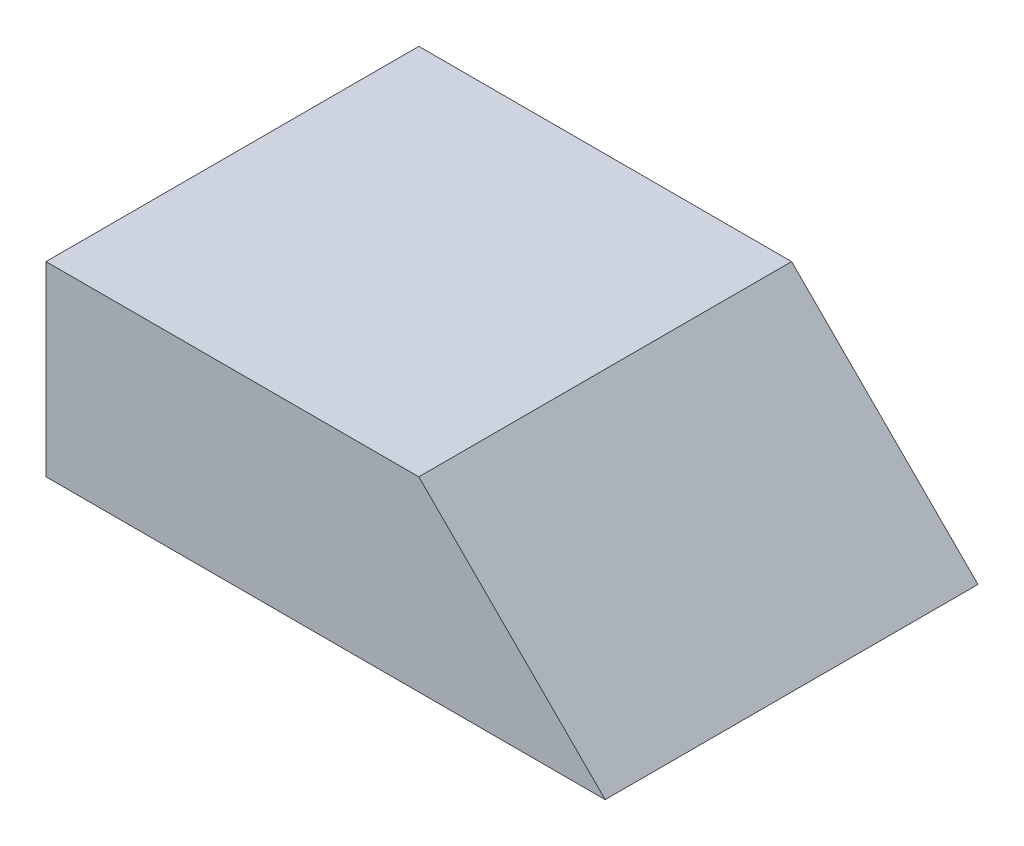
ISO-10303-21;
HEADER;
FILE_DESCRIPTION(('STEP AP214'),'2;1');
FILE_NAME('part.step','',(''),(''),'','','');
FILE_SCHEMA(('AUTOMOTIVE_DESIGN { 1 0 10303 214 1 1 1 1 }'));
ENDSEC;
DATA;
#1=APPLICATION_CONTEXT('core data for automotive mechanical design processes');
#2=APPLICATION_PROTOCOL_DEFINITION('international standard','automotive_design',2000,#1);
#3=PRODUCT_CONTEXT('',#1,'mechanical');
#4=PRODUCT('Part','Part','',(#3));
#5=PRODUCT_RELATED_PRODUCT_CATEGORY('part','',(#4));
#6=PRODUCT_DEFINITION_FORMATION('','',#4);
#7=PRODUCT_DEFINITION_CONTEXT('part definition',#1,'design');
#8=PRODUCT_DEFINITION('design','',#6,#7);
#9=PRODUCT_DEFINITION_SHAPE('','',#8);
#10=(LENGTH_UNIT() NAMED_UNIT(*) SI_UNIT(.MILLI.,.METRE.));
#11=(NAMED_UNIT(*) PLANE_ANGLE_UNIT() SI_UNIT($,.RADIAN.));
#12=(NAMED_UNIT(*) SI_UNIT($,.STERADIAN.) SOLID_ANGLE_UNIT());
#13=UNCERTAINTY_MEASURE_WITH_UNIT(LENGTH_MEASURE(1.E-05),#10,'distance_accuracy_value','');
#14=(GEOMETRIC_REPRESENTATION_CONTEXT(3) GLOBAL_UNCERTAINTY_ASSIGNED_CONTEXT((#13)) GLOBAL_UNIT_ASSIGNED_CONTEXT((#10,
#11,#12)) REPRESENTATION_CONTEXT('',''));
#15=CARTESIAN_POINT('',(0.,0.,0.));
#16=DIRECTION('',(0.,0.,1.));
#17=DIRECTION('',(1.,0.,0.));
#18=AXIS2_PLACEMENT_3D('',#15,#16,#17);
#19=CARTESIAN_POINT('',(-3.,0.,2.));
#20=DIRECTION('',(1.,0.,0.));
#21=DIRECTION('',(0.,1.,0.));
#22=AXIS2_PLACEMENT_3D('',#19,#20,#21);
#23=PLANE('',#22);
#24=DIRECTION('',(0.,-1.,0.));
#25=VECTOR('',#24,1.);
#26=CARTESIAN_POINT('',(-3.,0.,0.));
#27=LINE('',#26,#25);
#28=CARTESIAN_POINT('',(-3.,1.,0.));
#29=VERTEX_POINT('',#28);
#30=CARTESIAN_POINT('',(-3.,0.,0.));
#31=VERTEX_POINT('',#30);
#32=EDGE_CURVE('E107',#29,#31,#27,.T.);
#33=ORIENTED_EDGE('',*,*,#32,.T.);
#34=DIRECTION('',(0.,0.,-1.));
#35=VECTOR('',#34,1.);
#36=CARTESIAN_POINT('',(-3.,0.,2.));
#37=LINE('',#36,#35);
#38=CARTESIAN_POINT('',(-3.,0.,2.));
#39=VERTEX_POINT('',#38);
#40=EDGE_CURVE('E11',#39,#31,#37,.T.);
#41=ORIENTED_EDGE('',*,*,#40,.F.);
#42=DIRECTION('',(0.,-1.,0.));
#43=VECTOR('',#42,1.);
#44=CARTESIAN_POINT('',(-3.,0.,2.));
#45=LINE('',#44,#43);
#46=CARTESIAN_POINT('',(-3.,1.,2.));
#47=VERTEX_POINT('',#46);
#48=EDGE_CURVE('E91',#47,#39,#45,.T.);
#49=ORIENTED_EDGE('',*,*,#48,.F.);
#50=DIRECTION('',(0.,0.,-1.));
#51=VECTOR('',#50,1.);
#52=CARTESIAN_POINT('',(-3.,1.,2.));
#53=LINE('',#52,#51);
#54=EDGE_CURVE('E103',#47,#29,#53,.T.);
#55=ORIENTED_EDGE('',*,*,#54,.T.);
#56=EDGE_LOOP('',(#33,#41,#49,#55));
#57=FACE_BOUND('',#56,.T.);
#58=ADVANCED_FACE('F39',(#57),#23,.F.);
#59=CARTESIAN_POINT('',(-3.,0.,2.));
#60=DIRECTION('',(0.,1.,0.));
#61=DIRECTION('',(0.,0.,1.));
#62=AXIS2_PLACEMENT_3D('',#59,#60,#61);
#63=PLANE('',#62);
#64=DIRECTION('',(1.,0.,0.));
#65=VECTOR('',#64,1.);
#66=CARTESIAN_POINT('',(-3.,0.,0.));
#67=LINE('',#66,#65);
#68=CARTESIAN_POINT('',(0.,0.,0.));
#69=VERTEX_POINT('',#68);
#70=EDGE_CURVE('E96',#31,#69,#67,.T.);
#71=ORIENTED_EDGE('',*,*,#70,.T.);
#72=DIRECTION('',(0.,0.,-1.));
#73=VECTOR('',#72,1.);
#74=CARTESIAN_POINT('',(0.,0.,2.));
#75=LINE('',#74,#73);
#76=CARTESIAN_POINT('',(0.,0.,2.));
#77=VERTEX_POINT('',#76);
#78=EDGE_CURVE('E48',#77,#69,#75,.T.);
#79=ORIENTED_EDGE('',*,*,#78,.F.);
#80=DIRECTION('',(1.,0.,0.));
#81=VECTOR('',#80,1.);
#82=CARTESIAN_POINT('',(-3.,0.,2.));
#83=LINE('',#82,#81);
#84=EDGE_CURVE('E86',#39,#77,#83,.T.);
#85=ORIENTED_EDGE('',*,*,#84,.F.);
#86=ORIENTED_EDGE('',*,*,#40,.T.);
#87=EDGE_LOOP('',(#71,#79,#85,#86));
#88=FACE_BOUND('',#87,.T.);
#89=ADVANCED_FACE('F95',(#88),#63,.F.);
#90=CARTESIAN_POINT('',(-1.,1.,2.));
#91=DIRECTION('',(-0.707106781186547,-0.707106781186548,0.));
#92=DIRECTION('',(0.707106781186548,-0.707106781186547,0.));
#93=AXIS2_PLACEMENT_3D('',#90,#91,#92);
#94=PLANE('',#93);
#95=DIRECTION('',(-0.707106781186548,0.707106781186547,0.));
#96=VECTOR('',#95,1.);
#97=CARTESIAN_POINT('',(-1.,1.,0.));
#98=LINE('',#97,#96);
#99=CARTESIAN_POINT('',(-1.,1.,0.));
#100=VERTEX_POINT('',#99);
#101=EDGE_CURVE('E73',#69,#100,#98,.T.);
#102=ORIENTED_EDGE('',*,*,#101,.T.);
#103=DIRECTION('',(0.,0.,-1.));
#104=VECTOR('',#103,1.);
#105=CARTESIAN_POINT('',(-1.,1.,2.));
#106=LINE('',#105,#104);
#107=CARTESIAN_POINT('',(-1.,1.,2.));
#108=VERTEX_POINT('',#107);
#109=EDGE_CURVE('E98',#108,#100,#106,.T.);
#110=ORIENTED_EDGE('',*,*,#109,.F.);
#111=DIRECTION('',(-0.707106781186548,0.707106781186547,0.));
#112=VECTOR('',#111,1.);
#113=CARTESIAN_POINT('',(-1.,1.,2.));
#114=LINE('',#113,#112);
#115=EDGE_CURVE('E89',#77,#108,#114,.T.);
#116=ORIENTED_EDGE('',*,*,#115,.F.);
#117=ORIENTED_EDGE('',*,*,#78,.T.);
#118=EDGE_LOOP('',(#102,#110,#116,#117));
#119=FACE_BOUND('',#118,.T.);
#120=ADVANCED_FACE('F99',(#119),#94,.F.);
#121=CARTESIAN_POINT('',(-3.,1.,2.));
#122=DIRECTION('',(0.,-1.,0.));
#123=DIRECTION('',(0.,0.,-1.));
#124=AXIS2_PLACEMENT_3D('',#121,#122,#123);
#125=PLANE('',#124);
#126=DIRECTION('',(-1.,0.,0.));
#127=VECTOR('',#126,1.);
#128=CARTESIAN_POINT('',(-3.,1.,0.));
#129=LINE('',#128,#127);
#130=EDGE_CURVE('E79',#100,#29,#129,.T.);
#131=ORIENTED_EDGE('',*,*,#130,.T.);
#132=ORIENTED_EDGE('',*,*,#54,.F.);
#133=DIRECTION('',(-1.,0.,0.));
#134=VECTOR('',#133,1.);
#135=CARTESIAN_POINT('',(-3.,1.,2.));
#136=LINE('',#135,#134);
#137=EDGE_CURVE('E56',#108,#47,#136,.T.);
#138=ORIENTED_EDGE('',*,*,#137,.F.);
#139=ORIENTED_EDGE('',*,*,#109,.T.);
#140=EDGE_LOOP('',(#131,#132,#138,#139));
#141=FACE_BOUND('',#140,.T.);
#142=ADVANCED_FACE('F120',(#141),#125,.F.);
#143=CARTESIAN_POINT('',(0.,0.,2.));
#144=DIRECTION('',(0.,0.,-1.));
#145=DIRECTION('',(-1.,0.,0.));
#146=AXIS2_PLACEMENT_3D('',#143,#144,#145);
#147=PLANE('',#146);
#148=ORIENTED_EDGE('',*,*,#48,.T.);
#149=ORIENTED_EDGE('',*,*,#84,.T.);
#150=ORIENTED_EDGE('',*,*,#115,.T.);
#151=ORIENTED_EDGE('',*,*,#137,.T.);
#152=EDGE_LOOP('',(#148,#149,#150,#151));
#153=FACE_BOUND('',#152,.T.);
#154=ADVANCED_FACE('F87',(#153),#147,.F.);
#155=CARTESIAN_POINT('',(0.,0.,0.));
#156=DIRECTION('',(0.,0.,-1.));
#157=DIRECTION('',(-1.,0.,0.));
#158=AXIS2_PLACEMENT_3D('',#155,#156,#157);
#159=PLANE('',#158);
#160=ORIENTED_EDGE('',*,*,#32,.F.);
#161=ORIENTED_EDGE('',*,*,#130,.F.);
#162=ORIENTED_EDGE('',*,*,#101,.F.);
#163=ORIENTED_EDGE('',*,*,#70,.F.);
#164=EDGE_LOOP('',(#160,#161,#162,#163));
#165=FACE_BOUND('',#164,.T.);
#166=ADVANCED_FACE('F123',(#165),#159,.T.);
#167=CLOSED_SHELL('',(#58,#89,#120,#142,#154,#166));
#168=MANIFOLD_SOLID_BREP('B2',#167);
#169=ADVANCED_BREP_SHAPE_REPRESENTATION('',(#18,#168),#14);
#170=SHAPE_DEFINITION_REPRESENTATION(#9,#169);
ENDSEC;
END-ISO-10303-21;
